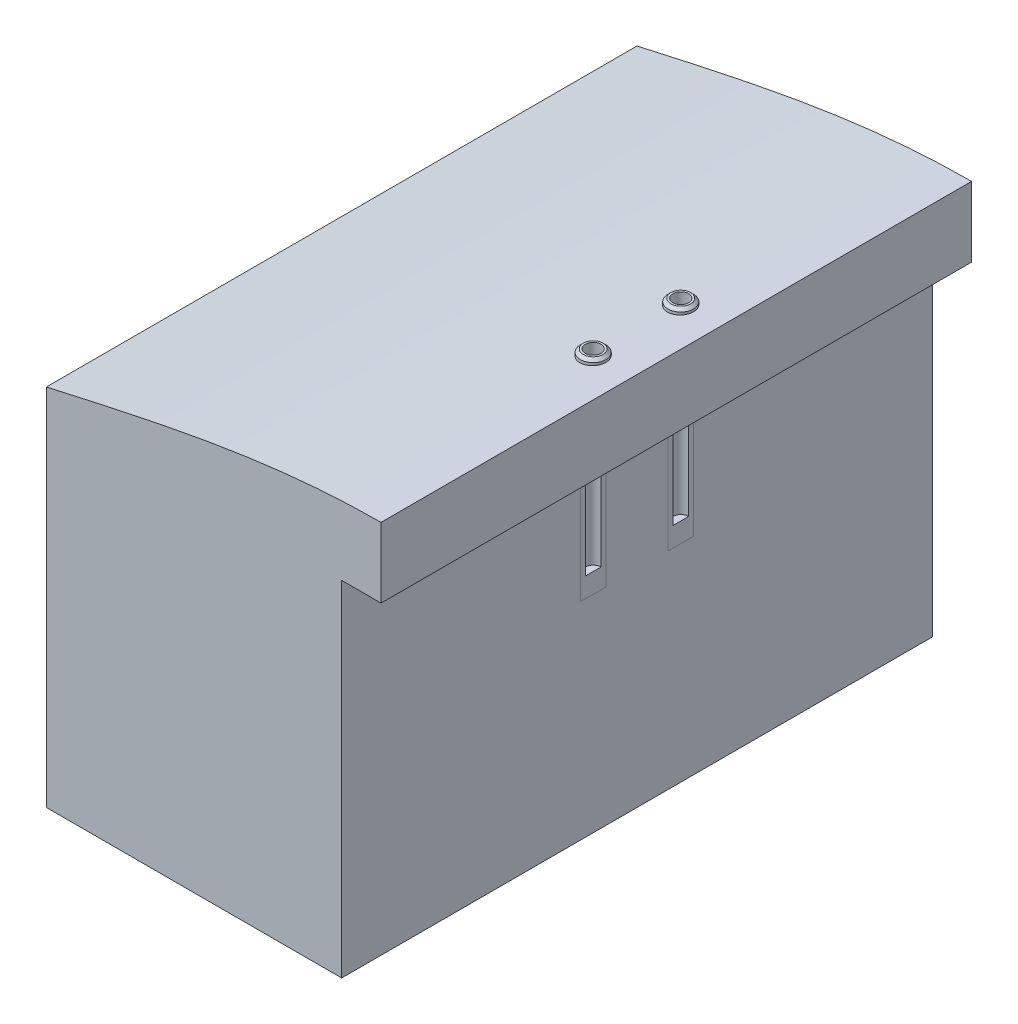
from build123d import *

# Parameters (mm, degrees)
EXTRUDE_BREDD_DEPTH                     = 300
SKETCH2_R                               = 13
CUT_BORRH_L_DEPTH                       = 210
CUT_BORRH_L_DIRECTION_2_REACH           = 598.883
EXTRUDE_INJEKTERINGSMEDEL_DEPTH         = 6
EXTRUDE_INJEKTERINGSMEDEL_DEPTH_BACK    = 210
SKETCH3_R                               = 13
EXTRUDE_INJEKTERINGSMEDEL_2_DEPTH       = 6
EXTRUDE_INJEKTERINGSMEDEL_2_DEPTH_BACK  = 210
CUT_H_L_F_R_F_RANKRINGSST_NG_DEPTH      = 6
CUT_H_L_F_R_F_RANKRINGSST_NG_DEPTH_BACK = 190
SKETCH6_R                               = 8
CHAMFER_OVANSIDA_INJEKTERING_SIZE       = 3
CUT_START                               = -190
SKETCH7_R                               = 8
CUT_H_L_F_R_F_RANKRINGSST_NG_2_DEPTH    = 196
CHAMFER_OVANSIDA_INJEKTERING_2_SIZE     = 3
CUT_SPR_NGSNITT_DEPTH                   = 597.883344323
CUT_SPR_NGSNITT_DEPTH_BACK              = 597.883344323


with BuildPart() as part:
    # Sketch1 → Extrude bredd (new, symmetric)
    with BuildSketch(Plane.XY):
        with BuildLine():
            Line((-300, -49.844883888), (-300, -419.844883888))
            Line((-300, -419.844883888), (300, -419.844883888))
            Line((300, -419.844883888), (300, -19.844883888))
            add(Edge.make_bspline(
                [(300, -19.844883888), (199.717435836, -7.502586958), (-2.000766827, 17.323921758), (-200.289099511, -27.370121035), (-300, -49.844883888)],
                knots=[0, 0, 0, 0, 0.497141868, 1, 1, 1, 1], degree=3))
        make_face()
    extrude(amount=EXTRUDE_BREDD_DEPTH, both=True)

    # Sketch2 → Cut borrh_l (cut)
    with BuildSketch(Plane(origin=(0, 0, 0), x_dir=(1, 0, 0), z_dir=(0, 1, 0))):
        with Locations(Location((0, -44.5, 0), (0, 0, 90))):
            Circle(SKETCH2_R)
        with Locations(Location((0, 44.5, 0), (0, 0, 90))):
            Circle(SKETCH2_R)
    extrude(amount=-CUT_BORRH_L_DEPTH, mode=Mode.SUBTRACT)

    # Sketch2 → Cut borrh_l direction 2 (cut, up to next)
    with BuildSketch(Plane(origin=(0, 0, 0), x_dir=(1, 0, 0), z_dir=(0, 1, 0)), mode=Mode.PRIVATE) as cut_borrh_l_direction_2_sk1:
        with Locations(Location((0, -44.5, 0), (0, 0, 90))):
            Circle(SKETCH2_R)
    cut_borrh_l_direction_2_tool1 = extrude(cut_borrh_l_direction_2_sk1.sketch, amount=CUT_BORRH_L_DIRECTION_2_REACH, mode=Mode.PRIVATE) & part.part
    # Sketch2 → Cut borrh_l direction 2 (cut, up to next)
    with BuildSketch(Plane(origin=(0, 0, 0), x_dir=(1, 0, 0), z_dir=(0, 1, 0)), mode=Mode.PRIVATE) as cut_borrh_l_direction_2_sk2:
        with Locations(Location((0, 44.5, 0), (0, 0, 90))):
            Circle(SKETCH2_R)
    cut_borrh_l_direction_2_tool2 = extrude(cut_borrh_l_direction_2_sk2.sketch, amount=CUT_BORRH_L_DIRECTION_2_REACH, mode=Mode.PRIVATE) & part.part
    add(cut_borrh_l_direction_2_tool1.solids().sort_by_distance((0, 0, 44.5))[0], mode=Mode.SUBTRACT)
    add(cut_borrh_l_direction_2_tool2.solids().sort_by_distance((0, 0, -44.5))[0], mode=Mode.SUBTRACT)


with BuildPart() as body_2:
    # Sketch3 → Extrude injekteringsmedel (new, two sides: drawn at the far end of the back side and taken through both)
    with BuildSketch(Plane(origin=(0, 0, 0), x_dir=(1, 0, 0), z_dir=(0, 1, 0)).offset(-EXTRUDE_INJEKTERINGSMEDEL_DEPTH_BACK)):
        with Locations(Location((0, 44.5, 0), (0, 0, 270))):
            Circle(SKETCH3_R)
    extrude(amount=EXTRUDE_INJEKTERINGSMEDEL_DEPTH + EXTRUDE_INJEKTERINGSMEDEL_DEPTH_BACK)

    # Sketch7 → Cut h_l f_r f_rankringsst_ng 2 (cut)
    with BuildSketch(Plane(origin=(0, 0, 0), x_dir=(1, 0, 0), z_dir=(0, 1, 0)).offset(CUT_START)):
        with Locations(Location((0, 44.5, 0), (0, 0, 270))):
            Circle(SKETCH7_R)
    extrude(amount=CUT_H_L_F_R_F_RANKRINGSST_NG_2_DEPTH, mode=Mode.SUBTRACT)

    # Chamfer ovansida injektering 2
    chamfer_ovansida_injektering_2_edges = [body_2.edges().sort_by_distance(p)[0] for p in [
        (0, 6, -57.5),
    ]]
    chamfer(chamfer_ovansida_injektering_2_edges, length=CHAMFER_OVANSIDA_INJEKTERING_2_SIZE)


with BuildPart() as body_3:
    # Sketch3 → Extrude injekteringsmedel 2 (new, two sides: drawn at the far end of the back side and taken through both)
    with BuildSketch(Plane(origin=(0, 0, 0), x_dir=(1, 0, 0), z_dir=(0, 1, 0)).offset(-EXTRUDE_INJEKTERINGSMEDEL_2_DEPTH_BACK)):
        with Locations(Location((0, -44.5, 0), (0, 0, 270))):
            Circle(SKETCH3_R)
    extrude(amount=EXTRUDE_INJEKTERINGSMEDEL_2_DEPTH + EXTRUDE_INJEKTERINGSMEDEL_2_DEPTH_BACK)

    # Sketch6 → Cut h_l f_r f_rankringsst_ng (cut, two sides: drawn at the far end of the back side and taken through both)
    with BuildSketch(Plane(origin=(0, 0, 0), x_dir=(-1, 0, 0), z_dir=(0, 1, 0)).offset(-CUT_H_L_F_R_F_RANKRINGSST_NG_DEPTH_BACK)):
        with Locations(Location((0, 44.5, 0), (0, 0, 90))):
            Circle(SKETCH6_R)
    extrude(amount=CUT_H_L_F_R_F_RANKRINGSST_NG_DEPTH + CUT_H_L_F_R_F_RANKRINGSST_NG_DEPTH_BACK, mode=Mode.SUBTRACT)

    # Chamfer ovansida injektering
    chamfer_ovansida_injektering_edges = [body_3.edges().sort_by_distance(p)[0] for p in [
        (0, 6, 31.5),
    ]]
    chamfer(chamfer_ovansida_injektering_edges, length=CHAMFER_OVANSIDA_INJEKTERING_SIZE)


with BuildPart() as cut_spr_ngsnitt_tool:
    # Sketch5 → Cut spr_ngsnitt (new, two sides: drawn at the far end of the back side and taken through both)
    with BuildSketch(Plane.XY.offset(-CUT_SPR_NGSNITT_DEPTH_BACK)):
        Polygon((40, 1219.921057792), (40, 50), (40, -70), (0, -70), (0, -419.844883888), (0, -1589.765941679), (2339.605035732, -1623.073638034), (2379.605035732, 1186.613361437), align=None)
    extrude(amount=CUT_SPR_NGSNITT_DEPTH + CUT_SPR_NGSNITT_DEPTH_BACK)


with BuildPart() as part_1:
    add(part.part)

    # Cut spr_ngsnitt: cut by cut_spr_ngsnitt_tool
    add(cut_spr_ngsnitt_tool.part, mode=Mode.SUBTRACT)


with BuildPart() as body_2_1:
    add(body_2.part)

    # Cut spr_ngsnitt: cut by cut_spr_ngsnitt_tool
    add(cut_spr_ngsnitt_tool.part, mode=Mode.SUBTRACT)


with BuildPart() as body_3_1:
    add(body_3.part)

    # Cut spr_ngsnitt: cut by cut_spr_ngsnitt_tool
    add(cut_spr_ngsnitt_tool.part, mode=Mode.SUBTRACT)


solid = Compound([part_1.part, body_2_1.part, body_3_1.part])
